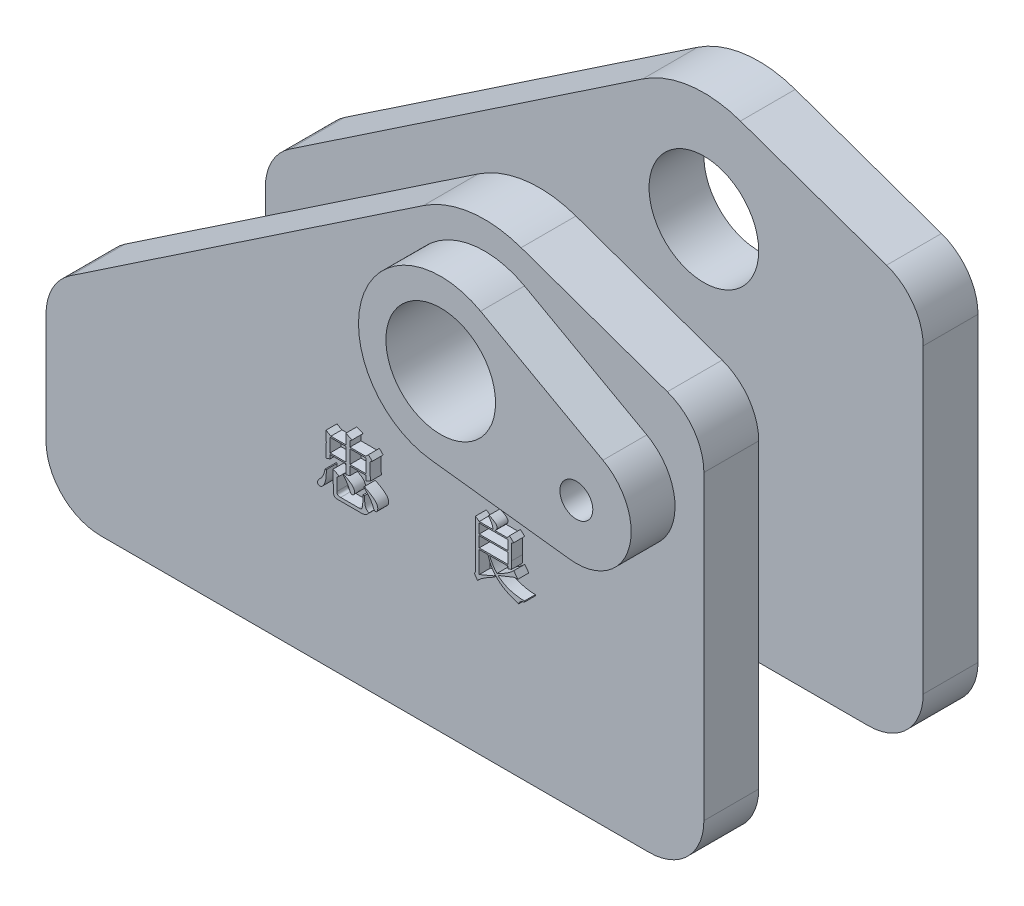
from build123d import *

# Parameters (mm, degrees)
EXTRUDE_START       = 15
EXTRUDE_1_DEPTH     = 10
EXTRUDE_START_2     = -25
EXTRUDE_2_DEPTH     = 10
FILLET_1_R          = 10
FILLET_2_R          = 10
EXTRUDE_3_DEPTH     = 8
SKETCH_4_R          = 10
CUT_EXTRUDE_1_DEPTH = 159.079094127
SKETCH_5_R          = 3
CUT_EXTRUDE_2_DEPTH = 30
SKETCH_6_W          = 40
SKETCH_6_H          = 8
EXTRUDE_4_DEPTH     = 40
SKETCH_7_W          = 2.926953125
SKETCH_7_H          = 2.48046875
SKETCH_7_W_2        = 2.9765625
SKETCH_7_W_3        = 5.208984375
SKETCH_7_H_2        = 1.934765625
SKETCH_7_H_3        = 1.736328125
EXTRUDE_5_DEPTH     = 2


with BuildPart() as part:
    # Sketch 1 → Extrude 1 (new body)
    with BuildSketch(Plane.XY.offset(EXTRUDE_START)):
        with BuildLine():
            Line((-120, 0), (0, 0))
            Line((0, 0), (0, 65))
            ThreePointArc((0, 65), (-1.835034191, 70.773502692), (-6.666666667, 74.428090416))
            Line((-6.666666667, 74.428090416), (-33.333333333, 83.856180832))
            ThreePointArc((-33.333333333, 83.856180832), (-42.512705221, 84.841529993), (-51.156671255, 81.599056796))
            Line((-51.156671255, 81.599056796), (-115.578335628, 38.299528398))
            ThreePointArc((-115.578335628, 38.299528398), (-118.825626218, 34.70194873), (-120, 30))
            Line((-120, 30), (-120, 0))
        make_face()
    extrude(amount=EXTRUDE_1_DEPTH)

    # Fillet 1
    fillet_1_edges = [part.edges().sort_by_distance(p)[0] for p in [
        (0, 0, 20),
        (-120, 0, 20),
    ]]
    fillet(fillet_1_edges, radius=FILLET_1_R)

    # Sketch 3 → Extrude 3 (add)
    with BuildSketch(Plane.XY.offset(25)):
        with BuildLine():
            Line((-41.784566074, 50.106534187), (-16.451076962, 47.071022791))
            ThreePointArc((-16.451076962, 47.071022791), (-5.74650711, 53.923076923), (-10.412094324, 65.745545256))
            Line((-10.412094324, 65.745545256), (-32.726092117, 78.118317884))
            ThreePointArc((-32.726092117, 78.118317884), (-54.272288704, 69.615384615), (-41.784566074, 50.106534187))
        make_face()
    extrude(amount=EXTRUDE_3_DEPTH)


with BuildPart() as body_2:
    # Sketch 2 → Extrude 2 (new body)
    with BuildSketch(Plane.XY.offset(EXTRUDE_START_2)):
        with BuildLine():
            Line((-120, 30), (-120, 0))
            Line((-120, 0), (0, 0))
            Line((0, 0), (0, 65))
            ThreePointArc((0, 65), (-1.835034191, 70.773502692), (-6.666666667, 74.428090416))
            Line((-6.666666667, 74.428090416), (-33.333333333, 83.856180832))
            ThreePointArc((-33.333333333, 83.856180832), (-42.512705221, 84.841529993), (-51.156671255, 81.599056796))
            Line((-51.156671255, 81.599056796), (-115.578335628, 38.299528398))
            ThreePointArc((-115.578335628, 38.299528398), (-118.825626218, 34.70194873), (-120, 30))
        make_face()
    extrude(amount=EXTRUDE_2_DEPTH)

    # Fillet 2
    fillet_2_edges = [body_2.edges().sort_by_distance(p)[0] for p in [
        (-120, 0, -20),
        (0, 0, -20),
    ]]
    fillet(fillet_2_edges, radius=FILLET_2_R)


with BuildPart() as cut_extrude_1_tool:
    # Sketch 4 → Cut-Extrude 1 (new, through all)
    with BuildSketch(Plane.XY.offset(33)):
        with Locations((-40, 65)):
            Circle(SKETCH_4_R)
    extrude(amount=-CUT_EXTRUDE_1_DEPTH)


with BuildPart() as part_1:
    add(part.part)

    # Cut-Extrude 1: cut by cut_extrude_1_tool
    add(cut_extrude_1_tool.part, mode=Mode.SUBTRACT)

    # Sketch 5 → Cut-Extrude 2 (cut)
    with BuildSketch(Plane.XY.offset(33)):
        with Locations((-15.261366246, 57)):
            Circle(SKETCH_5_R)
    extrude(amount=-CUT_EXTRUDE_2_DEPTH, mode=Mode.SUBTRACT)



with BuildPart() as body_2_1:
    add(body_2.part)

    # Cut-Extrude 1: cut by cut_extrude_1_tool
    add(cut_extrude_1_tool.part, mode=Mode.SUBTRACT)


with BuildPart() as part_2:
    add(part_1.part)

    add(body_2_1.part)  # Extrude 4 merges body 2
    # Sketch 6 → Extrude 4 (add)
    with BuildSketch(Plane.XY.offset(25)):
        with Locations((-50, 26)):
            Rectangle(SKETCH_6_W, SKETCH_6_H)
    extrude(amount=-EXTRUDE_4_DEPTH)

    # Sketch 7 → Extrude 5 (add)
    # profile 1 of 6: a face of its own
    with BuildSketch(Plane.XY.offset(25)):
        with BuildLine():
            add(Edge.make_bspline(
                [(-65.590057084, 30.394348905), (-65.59504888, 30.309225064), (-65.604341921, 30.150753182), (-65.580234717, 29.927698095), (-65.520709, 29.738401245), (-65.423457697, 29.583690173), (-65.288842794, 29.467219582), (-65.120725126, 29.388761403), (-64.918730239, 29.349759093), (-64.77440371, 29.351577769), (-64.697088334, 29.35255203)],
                knots=[0, 0, 0, 0, 1.255499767, 2.337317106, 3.288071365, 4.157121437, 4.995424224, 5.875797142, 6.862069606, 8, 8, 8, 8], degree=3))
            Line((-64.697088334, 29.35255203), (-60.381072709, 29.35255203))
            add(Edge.make_bspline(
                [(-60.381072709, 29.35255203), (-60.312899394, 29.358421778), (-60.179091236, 29.369942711), (-59.984981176, 29.412158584), (-59.804261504, 29.477438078), (-59.635117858, 29.559979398), (-59.479402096, 29.664501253), (-59.335494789, 29.788207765), (-59.203513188, 29.93230337), (-59.129135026, 30.041196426), (-59.091228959, 30.096692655)],
                knots=[0, 0, 0, 0, 1.058771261, 2.078118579, 3.064966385, 4.027688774, 4.985071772, 5.960185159, 6.960429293, 8, 8, 8, 8], degree=3))
            add(Edge.make_bspline(
                [(-59.091228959, 30.096692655), (-59.138972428, 30.121425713), (-59.231404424, 30.169309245), (-59.356442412, 30.25525295), (-59.46771616, 30.34438862), (-59.562458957, 30.441832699), (-59.644256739, 30.543300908), (-59.706780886, 30.653760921), (-59.755806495, 30.768868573), (-59.788285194, 30.892937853), (-59.810872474, 31.027342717), (-59.832446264, 31.174509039), (-59.855937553, 31.337134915), (-59.872228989, 31.515762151), (-59.891787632, 31.709744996), (-59.907729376, 31.918673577), (-59.922651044, 32.14344776), (-59.930516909, 32.298478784), (-59.934588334, 32.378723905)],
                knots=[0, 0, 0, 0, 0.995482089, 1.927266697, 2.806486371, 3.633148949, 4.44145384, 5.214319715, 5.977372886, 6.753813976, 7.584207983, 8.502344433, 9.510364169, 10.628413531, 11.825527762, 13.123423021, 14.511064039, 16, 16, 16, 16], degree=3))
            Line((-59.934588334, 32.378723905), (-60.182635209, 32.378723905))
            add(Edge.make_bspline(
                [(-60.182635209, 32.378723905), (-60.184023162, 32.218255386), (-60.18672534, 31.905842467), (-60.198096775, 31.451181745), (-60.223348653, 31.024238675), (-60.247822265, 30.689464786), (-60.27851665, 30.445669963), (-60.318652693, 30.292823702), (-60.372565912, 30.165616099), (-60.442967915, 30.064711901), (-60.530528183, 29.990522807), (-60.635301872, 29.948660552), (-60.753310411, 29.930972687), (-60.8343353, 29.942023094), (-60.877166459, 29.94786453)],
                knots=[0, 0, 0, 0, 2.048534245, 3.988249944, 5.804945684, 7.50734794, 8.273583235, 8.937358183, 9.518444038, 10.028316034, 10.494801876, 10.960894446, 11.45071082, 12, 12, 12, 12], degree=3))
            Line((-60.877166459, 29.94786453), (-64.250603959, 29.94786453))
            add(Edge.make_bspline(
                [(-64.250603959, 29.94786453), (-64.308119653, 29.942242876), (-64.414729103, 29.931822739), (-64.56404053, 29.945261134), (-64.689507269, 29.984484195), (-64.787867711, 30.055522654), (-64.858906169, 30.153883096), (-64.898129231, 30.279349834), (-64.911567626, 30.428661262), (-64.901147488, 30.535270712), (-64.895525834, 30.592786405)],
                knots=[0, 0, 0, 0, 1.230372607, 2.280583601, 3.176959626, 4, 4.823040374, 5.719416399, 6.769627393, 8, 8, 8, 8], degree=3))
            Line((-64.895525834, 30.592786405), (-64.895525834, 32.82520828))
            Line((-64.895525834, 32.82520828), (-64.498650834, 33.172473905))
            Line((-64.498650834, 33.172473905), (-65.639666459, 33.71817703))
            add(Edge.make_bspline(
                [(-65.639666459, 33.71817703), (-65.635942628, 33.628760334), (-65.627883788, 33.435251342), (-65.616038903, 33.124166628), (-65.610311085, 32.771308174), (-65.60205406, 32.37691168), (-65.596841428, 31.94082388), (-65.593899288, 31.46248145), (-65.588968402, 30.94251004), (-65.589684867, 30.581763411), (-65.590057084, 30.394348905)],
                knots=[0, 0, 0, 0, 0.646083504, 1.398206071, 2.247317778, 3.193683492, 4.246083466, 5.395706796, 6.647021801, 8, 8, 8, 8], degree=3))
        make_face()
    # profile 2 of 6: a face of its own
    with BuildSketch(Plane.XY.offset(25)):
        with BuildLine():
            add(Edge.make_bspline(
                [(-63.804119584, 33.71817703), (-63.736182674, 33.641489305), (-63.604744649, 33.493121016), (-63.422608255, 33.269185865), (-63.256926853, 33.055793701), (-63.111725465, 32.849347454), (-62.983698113, 32.65261805), (-62.875601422, 32.463472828), (-62.783711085, 32.283197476), (-62.714477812, 32.110981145), (-62.654515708, 31.953411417), (-62.589913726, 31.81720921), (-62.525103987, 31.700567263), (-62.456371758, 31.60649558), (-62.38923868, 31.529811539), (-62.316438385, 31.477842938), (-62.242805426, 31.443880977), (-62.167893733, 31.433683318), (-62.095611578, 31.43856522), (-62.029347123, 31.460540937), (-61.966003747, 31.489125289), (-61.91137442, 31.535057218), (-61.860254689, 31.591657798), (-61.815672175, 31.660748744), (-61.776127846, 31.742127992), (-61.744369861, 31.83400272), (-61.719714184, 31.933431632), (-61.710753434, 32.037468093), (-61.716347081, 32.143213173), (-61.737504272, 32.251085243), (-61.772134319, 32.361932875), (-61.825126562, 32.473513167), (-61.889562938, 32.588145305), (-61.97023463, 32.706887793), (-62.075418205, 32.830777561), (-62.213279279, 32.957872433), (-62.380947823, 33.095039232), (-62.584846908, 33.234172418), (-62.817292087, 33.385260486), (-63.083212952, 33.541820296), (-63.383155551, 33.701920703), (-63.594497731, 33.81035837), (-63.704900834, 33.867005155)],
                knots=[0, 0, 0, 0, 1.883392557, 3.643813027, 5.305949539, 6.849261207, 8.282899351, 9.619505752, 10.853261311, 11.99920962, 13.030060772, 13.951820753, 14.768868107, 15.47835323, 16.091907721, 16.632517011, 17.111574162, 17.567023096, 18.007470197, 18.431340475, 18.844301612, 19.276906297, 19.731379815, 20.243566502, 20.782413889, 21.39140503, 22.027783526, 22.660865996, 23.303588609, 23.968324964, 24.677005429, 25.432785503, 26.234480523, 27.093365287, 28.068011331, 29.215010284, 30.535727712, 32.047665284, 33.749900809, 35.632788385, 37.718611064, 40, 40, 40, 40], degree=3))
            Line((-63.704900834, 33.867005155), (-63.804119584, 33.71817703))
        make_face()
    # profile 3 of 6: a face of its own
    with BuildSketch(Plane.XY.offset(25)):
        with BuildLine():
            add(Edge.make_bspline(
                [(-60.033807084, 33.668567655), (-59.961857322, 33.603963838), (-59.822851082, 33.479149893), (-59.626378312, 33.293350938), (-59.447046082, 33.117303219), (-59.287758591, 32.947626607), (-59.143333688, 32.788528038), (-59.018596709, 32.636183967), (-58.911420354, 32.492612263), (-58.792373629, 32.314801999), (-58.665278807, 32.098056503), (-58.52720387, 31.842293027), (-58.402590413, 31.590567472), (-58.315254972, 31.382231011), (-58.252462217, 31.224494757), (-58.19729351, 31.127055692), (-58.145771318, 31.043640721), (-58.090813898, 30.97747153), (-58.032418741, 30.931229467), (-57.974576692, 30.89661824), (-57.912118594, 30.884067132), (-57.850317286, 30.888131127), (-57.790161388, 30.906666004), (-57.735276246, 30.941423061), (-57.682084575, 30.985716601), (-57.636672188, 31.045979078), (-57.596675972, 31.118816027), (-57.559195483, 31.203965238), (-57.52990053, 31.303148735), (-57.501184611, 31.41216932), (-57.483612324, 31.529900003), (-57.48710676, 31.652278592), (-57.502981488, 31.77718079), (-57.538539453, 31.904479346), (-57.59337693, 32.032700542), (-57.661005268, 32.164724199), (-57.749451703, 32.296546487), (-57.853042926, 32.436085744), (-57.986954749, 32.579812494), (-58.155726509, 32.729745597), (-58.360817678, 32.889713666), (-58.60396709, 33.057591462), (-58.883665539, 33.235549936), (-59.200202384, 33.422414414), (-59.553464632, 33.619539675), (-59.803769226, 33.749482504), (-59.934588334, 33.81739578)],
                knots=[0, 0, 0, 0, 1.613577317, 3.117415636, 4.51224261, 5.80637764, 7.000602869, 8.097248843, 9.090689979, 9.989280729, 11.666720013, 13.280976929, 14.839662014, 16.350776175, 17.051309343, 17.668783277, 18.215938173, 18.687080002, 19.094107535, 19.455456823, 19.800237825, 20.138133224, 20.480786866, 20.838358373, 21.215271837, 21.630304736, 22.087950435, 22.600608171, 23.179218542, 23.811321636, 24.481992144, 25.156622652, 25.847546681, 26.579009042, 27.353410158, 28.171688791, 29.050473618, 29.998944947, 31.069417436, 32.321376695, 33.762793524, 35.407246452, 37.25014199, 39.293935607, 41.540424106, 44, 44, 44, 44], degree=3))
            Line((-59.934588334, 33.81739578), (-60.033807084, 33.668567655))
        make_face()
    # profile 4 of 6: a face of its own
    with BuildSketch(Plane.XY.offset(25)):
        with BuildLine():
            add(Edge.make_bspline(
                [(-67.078338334, 33.02364578), (-67.103634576, 32.91191818), (-67.152267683, 32.697117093), (-67.239467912, 32.389945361), (-67.33323679, 32.109512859), (-67.438543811, 31.856106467), (-67.551098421, 31.630025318), (-67.673882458, 31.431172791), (-67.801954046, 31.257223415), (-67.942685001, 31.1152423), (-68.077650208, 30.991310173), (-68.191907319, 30.86836906), (-68.285742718, 30.748581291), (-68.362195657, 30.635109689), (-68.419115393, 30.525773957), (-68.454724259, 30.419663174), (-68.472085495, 30.31789687), (-68.470734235, 30.221812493), (-68.451853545, 30.135000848), (-68.421917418, 30.058356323), (-68.375675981, 29.995966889), (-68.319146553, 29.944909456), (-68.249997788, 29.905219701), (-68.166680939, 29.882823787), (-68.072826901, 29.870061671), (-67.968870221, 29.870018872), (-67.858547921, 29.886425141), (-67.750042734, 29.933624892), (-67.643848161, 30.002447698), (-67.543097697, 30.09834462), (-67.445587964, 30.217120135), (-67.35199744, 30.360616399), (-67.260311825, 30.528209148), (-67.173176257, 30.720396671), (-67.09162904, 30.935111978), (-67.024608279, 31.172569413), (-66.970339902, 31.430569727), (-66.925892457, 31.708881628), (-66.895446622, 32.008239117), (-66.877390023, 32.328254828), (-66.872274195, 32.669050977), (-66.877305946, 32.902998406), (-66.879900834, 33.02364578)],
                knots=[0, 0, 0, 0, 1.847816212, 3.552505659, 5.149196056, 6.615355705, 7.976362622, 9.218557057, 10.382522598, 11.451706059, 12.437065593, 13.339037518, 14.155385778, 14.889829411, 15.543831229, 16.137502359, 16.688174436, 17.202071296, 17.676864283, 18.115420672, 18.518601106, 18.917399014, 19.337768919, 19.791103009, 20.299748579, 20.862954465, 21.46398037, 22.084192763, 22.755651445, 23.49677769, 24.317836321, 25.230407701, 26.25634744, 27.39709911, 28.632199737, 29.958217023, 31.372933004, 32.883662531, 34.502969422, 36.225066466, 38.053255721, 40, 40, 40, 40], degree=3))
            Line((-66.879900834, 33.02364578), (-67.078338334, 33.02364578))
        make_face()
    # profile 5 of 6: a face of its own
    with BuildSketch(Plane.XY.offset(25)):
        with BuildLine():
            Line((-63.308025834, 33.966223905), (-62.514275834, 34.263880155))
            add(Edge.make_bspline(
                [(-62.514275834, 34.263880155), (-62.522221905, 34.381440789), (-62.538435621, 34.621319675), (-62.551775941, 34.987119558), (-62.561556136, 35.365645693), (-62.563099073, 35.621700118), (-62.563885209, 35.752161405)],
                knots=[0, 0, 0, 0, 0.949289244, 1.936995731, 2.948886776, 4, 4, 4, 4], degree=3))
            Line((-62.563885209, 35.752161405), (-59.587322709, 35.752161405))
            Line((-59.587322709, 35.752161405), (-59.587322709, 34.90880203))
            Line((-59.587322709, 34.90880203), (-58.843182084, 35.20645828))
            add(Edge.make_bspline(
                [(-58.843182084, 35.20645828), (-58.846934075, 35.279949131), (-58.855217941, 35.44220653), (-58.866931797, 35.707971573), (-58.872633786, 36.019196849), (-58.880828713, 36.375006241), (-58.886038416, 36.775573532), (-58.888976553, 37.220843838), (-58.893892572, 37.711416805), (-58.893169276, 38.053790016), (-58.892791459, 38.232630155)],
                knots=[0, 0, 0, 0, 0.583464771, 1.288207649, 2.10912516, 3.051416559, 4.110155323, 5.285381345, 6.582007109, 8, 8, 8, 8], degree=3))
            Line((-58.892791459, 38.232630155), (-58.495916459, 38.530286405))
            Line((-58.495916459, 38.530286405), (-59.190447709, 39.224817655))
            Line((-59.190447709, 39.224817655), (-59.686541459, 38.728723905))
            Line((-59.686541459, 38.728723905), (-62.563885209, 38.728723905))
            Line((-62.563885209, 38.728723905), (-62.563885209, 39.720911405))
            Line((-62.563885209, 39.720911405), (-62.167010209, 40.06817703))
            Line((-62.167010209, 40.06817703), (-63.308025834, 40.56427078))
            add(Edge.make_bspline(
                [(-63.308025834, 40.56427078), (-63.293784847, 40.262381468), (-63.264937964, 39.650867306), (-63.26060855, 39.038686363), (-63.258416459, 38.728723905)],
                knots=[0, 0, 0, 0, 0.987350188, 2, 2, 2, 2], degree=3))
            Line((-63.258416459, 38.728723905), (-66.036541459, 38.728723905))
            Line((-66.036541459, 38.728723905), (-66.929510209, 39.224817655))
            add(Edge.make_bspline(
                [(-66.929510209, 39.224817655), (-66.925818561, 39.1635736), (-66.91799377, 39.033761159), (-66.90599337, 38.828669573), (-66.900224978, 38.602549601), (-66.891979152, 38.355773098), (-66.886707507, 38.088105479), (-66.883767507, 37.799006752), (-66.878831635, 37.489115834), (-66.880245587, 37.056084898), (-66.88215011, 36.522605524), (-66.891719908, 35.910736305), (-66.904868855, 35.34469883), (-66.921529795, 34.982887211), (-66.929510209, 34.80958328)],
                knots=[0, 0, 0, 0, 0.500082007, 1.059970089, 1.674291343, 2.343496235, 3.072459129, 3.85624204, 4.69992255, 5.598454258, 7.385561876, 9.048032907, 10.586039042, 12, 12, 12, 12], degree=3))
            Line((-66.929510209, 34.80958328), (-66.185369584, 35.057630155))
            Line((-66.185369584, 35.057630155), (-66.185369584, 35.752161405))
            Line((-66.185369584, 35.752161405), (-63.258416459, 35.752161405))
            add(Edge.make_bspline(
                [(-63.258416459, 35.752161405), (-63.25921432, 35.597203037), (-63.260788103, 35.291547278), (-63.270502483, 34.838915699), (-63.283990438, 34.398430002), (-63.300091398, 34.108901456), (-63.308025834, 33.966223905)],
                knots=[0, 0, 0, 0, 1.040648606, 2.052681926, 3.040375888, 4, 4, 4, 4], degree=3))
        make_face()
        with Locations((-64.721893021, 37.240442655)):
            Rectangle(SKETCH_7_W, SKETCH_7_H, mode=Mode.SUBTRACT)
        with Locations((-61.075603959, 37.240442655)):
            Rectangle(SKETCH_7_W_2, SKETCH_7_H, mode=Mode.SUBTRACT)
    # profile 6 of 6: a face of its own
    with BuildSketch(Plane.XY.offset(25)):
        with BuildLine():
            Line((-33.123477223, 38.28223953), (-32.676992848, 38.57989578))
            Line((-32.676992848, 38.57989578), (-33.470742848, 39.27442703))
            Line((-33.470742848, 39.27442703), (-33.867617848, 38.77833328))
            Line((-33.867617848, 38.77833328), (-36.100039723, 38.77833328))
            add(Edge.make_bspline(
                [(-36.100039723, 38.77833328), (-36.061152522, 38.81482264), (-35.987001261, 38.884401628), (-35.895136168, 38.997599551), (-35.821192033, 39.10873744), (-35.768533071, 39.221253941), (-35.73889412, 39.335193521), (-35.728434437, 39.448587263), (-35.74303937, 39.561718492), (-35.775763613, 39.676759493), (-35.839166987, 39.79282781), (-35.93414867, 39.910159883), (-36.063050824, 40.028508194), (-36.223556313, 40.151371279), (-36.418392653, 40.276060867), (-36.646268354, 40.403008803), (-36.905891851, 40.536667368), (-37.092986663, 40.619761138), (-37.191445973, 40.66348953)],
                knots=[0, 0, 0, 0, 0.921763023, 1.757644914, 2.516034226, 3.22734963, 3.895682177, 4.544314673, 5.18449415, 5.858516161, 6.602854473, 7.455234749, 8.459845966, 9.623576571, 10.949315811, 12.458373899, 14.136206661, 16, 16, 16, 16], degree=3))
            Line((-37.191445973, 40.66348953), (-37.290664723, 40.514661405))
            add(Edge.make_bspline(
                [(-37.290664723, 40.514661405), (-37.231086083, 40.441168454), (-37.114784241, 40.297704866), (-36.957412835, 40.077104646), (-36.824399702, 39.855846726), (-36.706536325, 39.638691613), (-36.611008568, 39.421650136), (-36.535312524, 39.206113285), (-36.478533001, 38.992373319), (-36.45761849, 38.849021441), (-36.447305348, 38.77833328)],
                knots=[0, 0, 0, 0, 1.160200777, 2.264796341, 3.319857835, 4.3246282, 5.29322994, 6.224471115, 7.12446998, 8, 8, 8, 8], degree=3))
            Line((-36.447305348, 38.77833328), (-38.977383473, 38.77833328))
            Line((-38.977383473, 38.77833328), (-39.671914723, 39.27442703))
            add(Edge.make_bspline(
                [(-39.671914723, 39.27442703), (-39.663944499, 39.170958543), (-39.647404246, 38.956234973), (-39.634131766, 38.621020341), (-39.624576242, 38.261471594), (-39.623078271, 38.013376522), (-39.622305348, 37.88536453)],
                knots=[0, 0, 0, 0, 0.89563205, 1.858665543, 2.895115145, 4, 4, 4, 4], degree=3))
            Line((-39.622305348, 37.88536453), (-39.622305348, 30.74161453))
            add(Edge.make_bspline(
                [(-39.622305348, 30.74161453), (-39.632445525, 30.67943039), (-39.651697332, 30.561369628), (-39.70232406, 30.397725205), (-39.773463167, 30.257558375), (-39.838782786, 30.182552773), (-39.870352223, 30.14630203)],
                knots=[0, 0, 0, 0, 1.151470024, 2.186143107, 3.123350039, 4, 4, 4, 4], degree=3))
            Line((-39.870352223, 30.14630203), (-39.275039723, 29.302942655))
            add(Edge.make_bspline(
                [(-39.275039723, 29.302942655), (-39.252319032, 29.333413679), (-39.204185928, 29.39796563), (-39.115401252, 29.491186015), (-39.013067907, 29.592339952), (-38.893808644, 29.698090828), (-38.758005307, 29.809158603), (-38.606817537, 29.92579499), (-38.437826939, 30.047619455), (-38.253788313, 30.175559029), (-38.052730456, 30.307348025), (-37.837285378, 30.44639753), (-37.603441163, 30.588584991), (-37.354944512, 30.739336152), (-37.089058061, 30.894236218), (-36.806695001, 31.053001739), (-36.508792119, 31.219050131), (-36.304112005, 31.329800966), (-36.199258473, 31.386536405)],
                knots=[0, 0, 0, 0, 0.488111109, 1.034048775, 1.651917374, 2.337662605, 3.081489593, 3.906521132, 4.791417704, 5.758744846, 6.787053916, 7.881026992, 9.054232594, 10.304327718, 11.616619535, 13.008938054, 14.467738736, 16, 16, 16, 16], degree=3))
            Line((-36.199258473, 31.386536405), (-36.298477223, 31.53536453))
            Line((-36.298477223, 31.53536453), (-38.977383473, 30.394348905))
            Line((-38.977383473, 30.394348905), (-38.977383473, 34.363098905))
            Line((-38.977383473, 34.363098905), (-37.389883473, 34.363098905))
            add(Edge.make_bspline(
                [(-37.389883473, 34.363098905), (-37.351850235, 34.237777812), (-37.276900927, 33.990816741), (-37.146209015, 33.632692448), (-37.002783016, 33.292625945), (-36.848368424, 32.969695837), (-36.681478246, 32.664498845), (-36.501443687, 32.377073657), (-36.30766346, 32.108530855), (-36.103938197, 31.85643087), (-35.889439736, 31.621870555), (-35.671596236, 31.398977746), (-35.445958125, 31.190564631), (-35.21584408, 30.995332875), (-34.981289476, 30.811479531), (-34.740442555, 30.642913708), (-34.494148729, 30.486254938), (-34.152181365, 30.292580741), (-33.695179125, 30.067322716), (-33.10573336, 29.814790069), (-32.464781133, 29.571631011), (-32.01561833, 29.427082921), (-31.784024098, 29.35255203)],
                knots=[0, 0, 0, 0, 0.994130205, 1.959059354, 2.892591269, 3.79517888, 4.675404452, 5.5320163, 6.368206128, 7.188063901, 7.991271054, 8.780384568, 9.553597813, 10.322211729, 11.070948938, 11.815269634, 12.553113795, 13.286136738, 14.797879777, 16.418257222, 18.153206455, 20, 20, 20, 20], degree=3))
            add(Edge.make_bspline(
                [(-31.784024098, 29.35255203), (-31.769253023, 29.404632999), (-31.740330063, 29.50661175), (-31.667159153, 29.647344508), (-31.568660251, 29.769773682), (-31.450961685, 29.880410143), (-31.305257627, 29.969662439), (-31.139314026, 30.047424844), (-30.948920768, 30.107726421), (-30.812996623, 30.133094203), (-30.742227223, 30.14630203)],
                knots=[0, 0, 0, 0, 0.928693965, 1.818457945, 2.702851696, 3.619055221, 4.579706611, 5.625076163, 6.763487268, 8, 8, 8, 8], degree=3))
            Line((-30.742227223, 30.14630203), (-30.742227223, 30.34473953))
            add(Edge.make_bspline(
                [(-30.742227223, 30.34473953), (-30.943301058, 30.349635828), (-31.352112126, 30.359590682), (-31.972219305, 30.432772), (-32.607705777, 30.549730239), (-33.143442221, 30.681099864), (-33.571804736, 30.813470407), (-33.885960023, 30.931101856), (-34.189844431, 31.065105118), (-34.482219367, 31.216975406), (-34.766854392, 31.381807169), (-35.039434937, 31.566192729), (-35.304129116, 31.764438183), (-35.470668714, 31.909148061), (-35.554336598, 31.981848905)],
                knots=[0, 0, 0, 0, 1.393324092, 2.832821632, 4.321426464, 5.869748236, 6.65242656, 7.427424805, 8.193267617, 8.952625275, 9.709737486, 10.471416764, 11.232054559, 12, 12, 12, 12], degree=3))
            add(Edge.make_bspline(
                [(-35.554336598, 31.981848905), (-35.299107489, 32.087597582), (-34.792025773, 32.297695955), (-34.033376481, 32.603649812), (-33.279348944, 32.893572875), (-32.777615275, 33.079857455), (-32.528164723, 33.172473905)],
                knots=[0, 0, 0, 0, 1.019366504, 2.025247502, 3.018198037, 4, 4, 4, 4], degree=3))
            Line((-32.528164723, 33.172473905), (-31.932852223, 33.172473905))
            Line((-31.932852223, 33.172473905), (-32.676992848, 34.164661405))
            add(Edge.make_bspline(
                [(-32.676992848, 34.164661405), (-32.756660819, 34.084388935), (-32.923928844, 33.915851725), (-33.210560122, 33.67785686), (-33.535214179, 33.434839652), (-33.900176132, 33.188530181), (-34.306381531, 32.940241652), (-34.751331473, 32.686202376), (-35.237195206, 32.431082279), (-35.577148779, 32.265716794), (-35.752774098, 32.180286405)],
                knots=[0, 0, 0, 0, 0.737570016, 1.548575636, 2.427743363, 3.383165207, 4.420158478, 5.533433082, 6.725733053, 8, 8, 8, 8], degree=3))
            add(Edge.make_bspline(
                [(-35.752774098, 32.180286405), (-35.822277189, 32.256059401), (-35.961886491, 32.40826292), (-36.155534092, 32.65170675), (-36.340269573, 32.905610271), (-36.512886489, 33.172602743), (-36.674984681, 33.45213327), (-36.824422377, 33.744926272), (-36.968003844, 34.047592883), (-37.050548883, 34.257243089), (-37.092227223, 34.363098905)],
                knots=[0, 0, 0, 0, 0.957237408, 1.922781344, 2.89477216, 3.880339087, 4.882061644, 5.90239683, 6.940885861, 8, 8, 8, 8], degree=3))
            Line((-37.092227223, 34.363098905), (-33.768399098, 34.363098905))
            Line((-33.768399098, 34.363098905), (-33.768399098, 33.91661453))
            Line((-33.768399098, 33.91661453), (-33.073867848, 34.164661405))
            add(Edge.make_bspline(
                [(-33.073867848, 34.164661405), (-33.081699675, 34.284677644), (-33.096797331, 34.516036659), (-33.110859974, 34.851153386), (-33.120748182, 35.161078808), (-33.122594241, 35.359566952), (-33.123477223, 35.454505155)],
                knots=[0, 0, 0, 0, 1.117897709, 2.155005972, 3.117527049, 4, 4, 4, 4], degree=3))
            Line((-33.123477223, 35.454505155), (-33.123477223, 38.28223953))
        make_face()
        with Locations((-36.372891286, 35.578528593)):
            Rectangle(SKETCH_7_W_3, SKETCH_7_H_2, mode=Mode.SUBTRACT)
        with Locations((-36.372891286, 37.662122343)):
            Rectangle(SKETCH_7_W_3, SKETCH_7_H_3, mode=Mode.SUBTRACT)
    extrude(amount=EXTRUDE_5_DEPTH)


solid = part_2.part
